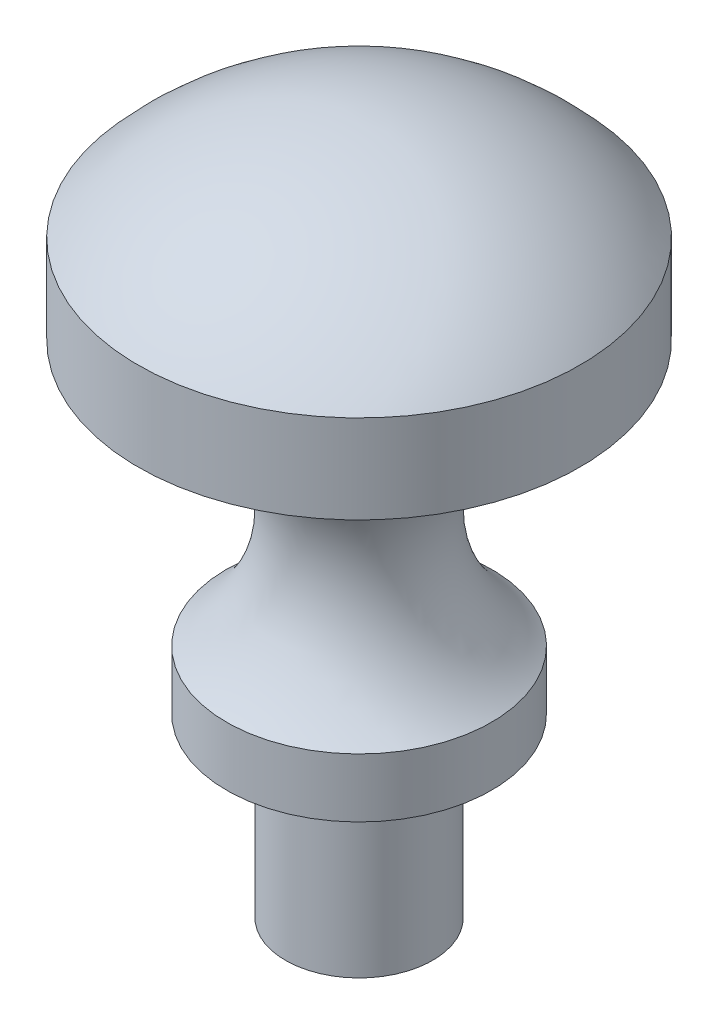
from build123d import *


with BuildPart() as part:
    # Sketch 1 → Revolve 1 (revolve)
    with BuildSketch(Plane.XY):
        with BuildLine():
            Line((0, 130), (-2.5, 130))
            Line((-2.5, 130), (-2.5, 136))
            Line((-2.5, 136), (-4.5, 136))
            Line((-4.5, 136), (-4.5, 138))
            ThreePointArc((-4.5, 138), (-2.75658351, 143.58113883), (-7.5, 147))
            Line((-7.5, 147), (-7.5, 150))
            ThreePointArc((-7.5, 150), (-4.114378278, 152.5), (0, 153.385621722))
            Line((0, 153.385621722), (0, 130))
        make_face()
    revolve(axis=Axis((0, 157.409669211, 0), (0, -1, 0)))


solid = part.part
